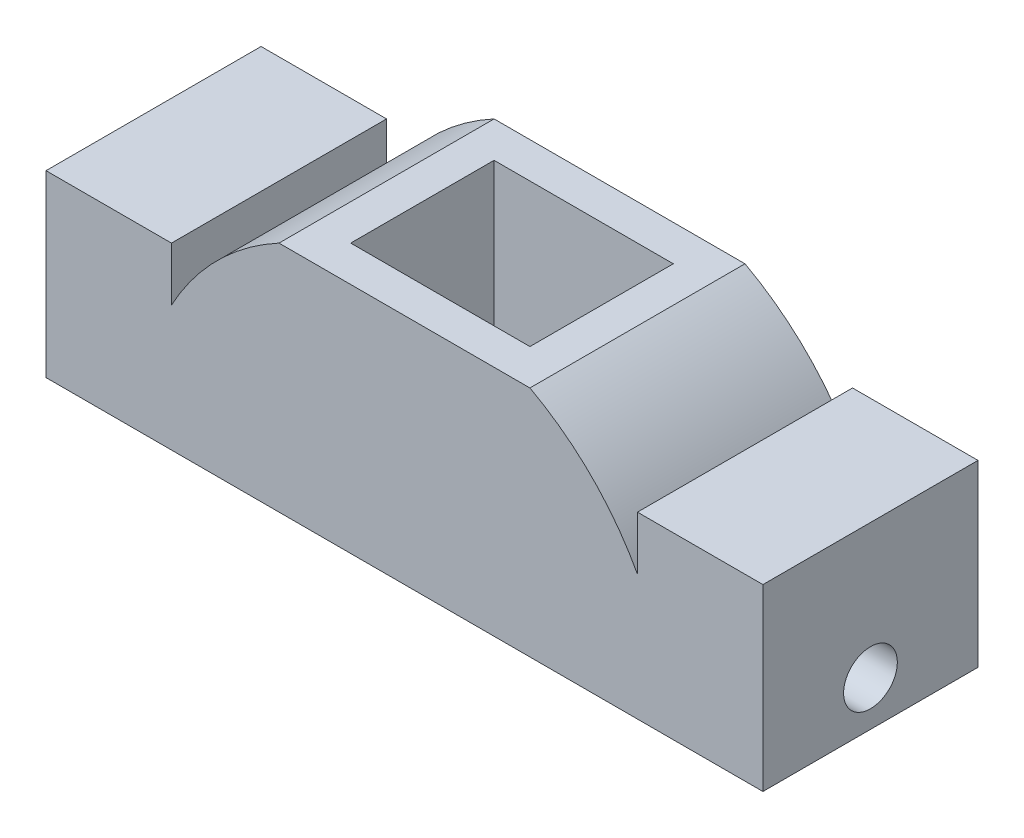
ISO-10303-21;
HEADER;
FILE_DESCRIPTION(('STEP AP214'),'2;1');
FILE_NAME('part.step','',(''),(''),'','','');
FILE_SCHEMA(('AUTOMOTIVE_DESIGN { 1 0 10303 214 1 1 1 1 }'));
ENDSEC;
DATA;
#1=APPLICATION_CONTEXT('core data for automotive mechanical design processes');
#2=APPLICATION_PROTOCOL_DEFINITION('international standard','automotive_design',2000,#1);
#3=PRODUCT_CONTEXT('',#1,'mechanical');
#4=PRODUCT('Part','Part','',(#3));
#5=PRODUCT_RELATED_PRODUCT_CATEGORY('part','',(#4));
#6=PRODUCT_DEFINITION_FORMATION('','',#4);
#7=PRODUCT_DEFINITION_CONTEXT('part definition',#1,'design');
#8=PRODUCT_DEFINITION('design','',#6,#7);
#9=PRODUCT_DEFINITION_SHAPE('','',#8);
#10=(LENGTH_UNIT() NAMED_UNIT(*) SI_UNIT(.MILLI.,.METRE.));
#11=(NAMED_UNIT(*) PLANE_ANGLE_UNIT() SI_UNIT($,.RADIAN.));
#12=(NAMED_UNIT(*) SI_UNIT($,.STERADIAN.) SOLID_ANGLE_UNIT());
#13=UNCERTAINTY_MEASURE_WITH_UNIT(LENGTH_MEASURE(1.E-05),#10,'distance_accuracy_value','');
#14=(GEOMETRIC_REPRESENTATION_CONTEXT(3) GLOBAL_UNCERTAINTY_ASSIGNED_CONTEXT((#13)) GLOBAL_UNIT_ASSIGNED_CONTEXT((#10,
#11,#12)) REPRESENTATION_CONTEXT('',''));
#15=CARTESIAN_POINT('',(0.,0.,0.));
#16=DIRECTION('',(0.,0.,1.));
#17=DIRECTION('',(1.,0.,0.));
#18=AXIS2_PLACEMENT_3D('',#15,#16,#17);
#19=CARTESIAN_POINT('',(0.,0.,60.));
#20=DIRECTION('',(0.,0.,-1.));
#21=DIRECTION('',(-1.,0.,0.));
#22=AXIS2_PLACEMENT_3D('',#19,#20,#21);
#23=CYLINDRICAL_SURFACE('',#22,73.824115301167);
#24=CARTESIAN_POINT('',(0.,0.,0.));
#25=DIRECTION('',(0.,0.,1.));
#26=DIRECTION('',(1.,0.,0.));
#27=AXIS2_PLACEMENT_3D('',#24,#25,#26);
#28=CIRCLE('',#27,73.824115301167);
#29=CARTESIAN_POINT('',(-35.,65.,0.));
#30=VERTEX_POINT('',#29);
#31=CARTESIAN_POINT('',(-65.,35.,0.));
#32=VERTEX_POINT('',#31);
#33=EDGE_CURVE('E183',#30,#32,#28,.T.);
#34=ORIENTED_EDGE('',*,*,#33,.T.);
#35=DIRECTION('',(0.,0.,-1.));
#36=VECTOR('',#35,1.);
#37=CARTESIAN_POINT('',(-65.,35.,60.));
#38=LINE('',#37,#36);
#39=CARTESIAN_POINT('',(-65.,35.,60.));
#40=VERTEX_POINT('',#39);
#41=EDGE_CURVE('E11',#40,#32,#38,.T.);
#42=ORIENTED_EDGE('',*,*,#41,.F.);
#43=CARTESIAN_POINT('',(0.,0.,60.));
#44=DIRECTION('',(0.,0.,1.));
#45=DIRECTION('',(1.,0.,0.));
#46=AXIS2_PLACEMENT_3D('',#43,#44,#45);
#47=CIRCLE('',#46,73.824115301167);
#48=CARTESIAN_POINT('',(-35.,65.,60.));
#49=VERTEX_POINT('',#48);
#50=EDGE_CURVE('E206',#49,#40,#47,.T.);
#51=ORIENTED_EDGE('',*,*,#50,.F.);
#52=DIRECTION('',(0.,0.,-1.));
#53=VECTOR('',#52,1.);
#54=CARTESIAN_POINT('',(-35.,65.,60.));
#55=LINE('',#54,#53);
#56=EDGE_CURVE('E227',#49,#30,#55,.T.);
#57=ORIENTED_EDGE('',*,*,#56,.T.);
#58=EDGE_LOOP('',(#34,#42,#51,#57));
#59=FACE_BOUND('',#58,.T.);
#60=ADVANCED_FACE('F33',(#59),#23,.T.);
#61=CARTESIAN_POINT('',(-65.,50.,60.));
#62=DIRECTION('',(-1.,0.,0.));
#63=DIRECTION('',(0.,0.,1.));
#64=AXIS2_PLACEMENT_3D('',#61,#62,#63);
#65=PLANE('',#64);
#66=DIRECTION('',(0.,1.,0.));
#67=VECTOR('',#66,1.);
#68=CARTESIAN_POINT('',(-65.,50.,0.));
#69=LINE('',#68,#67);
#70=CARTESIAN_POINT('',(-65.,50.,0.));
#71=VERTEX_POINT('',#70);
#72=EDGE_CURVE('E188',#32,#71,#69,.T.);
#73=ORIENTED_EDGE('',*,*,#72,.T.);
#74=DIRECTION('',(0.,0.,-1.));
#75=VECTOR('',#74,1.);
#76=CARTESIAN_POINT('',(-65.,50.,60.));
#77=LINE('',#76,#75);
#78=CARTESIAN_POINT('',(-65.,50.,60.));
#79=VERTEX_POINT('',#78);
#80=EDGE_CURVE('E40',#79,#71,#77,.T.);
#81=ORIENTED_EDGE('',*,*,#80,.F.);
#82=DIRECTION('',(0.,1.,0.));
#83=VECTOR('',#82,1.);
#84=CARTESIAN_POINT('',(-65.,50.,60.));
#85=LINE('',#84,#83);
#86=EDGE_CURVE('E209',#40,#79,#85,.T.);
#87=ORIENTED_EDGE('',*,*,#86,.F.);
#88=ORIENTED_EDGE('',*,*,#41,.T.);
#89=EDGE_LOOP('',(#73,#81,#87,#88));
#90=FACE_BOUND('',#89,.T.);
#91=ADVANCED_FACE('F278',(#90),#65,.F.);
#92=CARTESIAN_POINT('',(-100.,50.,60.));
#93=DIRECTION('',(0.,-1.,0.));
#94=DIRECTION('',(1.,0.,0.));
#95=AXIS2_PLACEMENT_3D('',#92,#93,#94);
#96=PLANE('',#95);
#97=DIRECTION('',(-1.,0.,0.));
#98=VECTOR('',#97,1.);
#99=CARTESIAN_POINT('',(-100.,50.,0.));
#100=LINE('',#99,#98);
#101=CARTESIAN_POINT('',(-100.,50.,0.));
#102=VERTEX_POINT('',#101);
#103=EDGE_CURVE('E190',#71,#102,#100,.T.);
#104=ORIENTED_EDGE('',*,*,#103,.T.);
#105=DIRECTION('',(0.,0.,-1.));
#106=VECTOR('',#105,1.);
#107=CARTESIAN_POINT('',(-100.,50.,60.));
#108=LINE('',#107,#106);
#109=CARTESIAN_POINT('',(-100.,50.,60.));
#110=VERTEX_POINT('',#109);
#111=EDGE_CURVE('E248',#110,#102,#108,.T.);
#112=ORIENTED_EDGE('',*,*,#111,.F.);
#113=DIRECTION('',(-1.,0.,0.));
#114=VECTOR('',#113,1.);
#115=CARTESIAN_POINT('',(-100.,50.,60.));
#116=LINE('',#115,#114);
#117=EDGE_CURVE('E211',#79,#110,#116,.T.);
#118=ORIENTED_EDGE('',*,*,#117,.F.);
#119=ORIENTED_EDGE('',*,*,#80,.T.);
#120=EDGE_LOOP('',(#104,#112,#118,#119));
#121=FACE_BOUND('',#120,.T.);
#122=ADVANCED_FACE('F255',(#121),#96,.F.);
#123=CARTESIAN_POINT('',(-100.,50.,60.));
#124=DIRECTION('',(1.,0.,0.));
#125=DIRECTION('',(0.,0.,-1.));
#126=AXIS2_PLACEMENT_3D('',#123,#124,#125);
#127=PLANE('',#126);
#128=CARTESIAN_POINT('',(-100.,12.5,30.));
#129=DIRECTION('',(1.,0.,0.));
#130=DIRECTION('',(0.,0.,-1.));
#131=AXIS2_PLACEMENT_3D('',#128,#129,#130);
#132=CIRCLE('',#131,7.5);
#133=CARTESIAN_POINT('',(-100.,12.5,22.5));
#134=VERTEX_POINT('',#133);
#135=EDGE_CURVE('E325',#134,#134,#132,.T.);
#136=ORIENTED_EDGE('',*,*,#135,.T.);
#137=EDGE_LOOP('',(#136));
#138=FACE_BOUND('',#137,.T.);
#139=DIRECTION('',(0.,-1.,0.));
#140=VECTOR('',#139,1.);
#141=CARTESIAN_POINT('',(-100.,50.,0.));
#142=LINE('',#141,#140);
#143=CARTESIAN_POINT('',(-100.,0.,0.));
#144=VERTEX_POINT('',#143);
#145=EDGE_CURVE('E192',#102,#144,#142,.T.);
#146=ORIENTED_EDGE('',*,*,#145,.T.);
#147=DIRECTION('',(0.,0.,-1.));
#148=VECTOR('',#147,1.);
#149=CARTESIAN_POINT('',(-100.,0.,60.));
#150=LINE('',#149,#148);
#151=CARTESIAN_POINT('',(-100.,0.,60.));
#152=VERTEX_POINT('',#151);
#153=EDGE_CURVE('E245',#152,#144,#150,.T.);
#154=ORIENTED_EDGE('',*,*,#153,.F.);
#155=DIRECTION('',(0.,-1.,0.));
#156=VECTOR('',#155,1.);
#157=CARTESIAN_POINT('',(-100.,50.,60.));
#158=LINE('',#157,#156);
#159=EDGE_CURVE('E213',#110,#152,#158,.T.);
#160=ORIENTED_EDGE('',*,*,#159,.F.);
#161=ORIENTED_EDGE('',*,*,#111,.T.);
#162=EDGE_LOOP('',(#146,#154,#160,#161));
#163=FACE_BOUND('',#162,.T.);
#164=ADVANCED_FACE('F266',(#138,#163),#127,.F.);
#165=CARTESIAN_POINT('',(-100.,0.,60.));
#166=DIRECTION('',(0.,1.,0.));
#167=DIRECTION('',(0.,0.,1.));
#168=AXIS2_PLACEMENT_3D('',#165,#166,#167);
#169=PLANE('',#168);
#170=DIRECTION('',(1.,0.,0.));
#171=VECTOR('',#170,1.);
#172=CARTESIAN_POINT('',(-100.,0.,0.));
#173=LINE('',#172,#171);
#174=CARTESIAN_POINT('',(100.,0.,0.));
#175=VERTEX_POINT('',#174);
#176=EDGE_CURVE('E194',#144,#175,#173,.T.);
#177=ORIENTED_EDGE('',*,*,#176,.T.);
#178=DIRECTION('',(0.,0.,-1.));
#179=VECTOR('',#178,1.);
#180=CARTESIAN_POINT('',(100.,0.,60.));
#181=LINE('',#180,#179);
#182=CARTESIAN_POINT('',(100.,0.,60.));
#183=VERTEX_POINT('',#182);
#184=EDGE_CURVE('E242',#183,#175,#181,.T.);
#185=ORIENTED_EDGE('',*,*,#184,.F.);
#186=DIRECTION('',(1.,0.,0.));
#187=VECTOR('',#186,1.);
#188=CARTESIAN_POINT('',(-100.,0.,60.));
#189=LINE('',#188,#187);
#190=EDGE_CURVE('E215',#152,#183,#189,.T.);
#191=ORIENTED_EDGE('',*,*,#190,.F.);
#192=ORIENTED_EDGE('',*,*,#153,.T.);
#193=EDGE_LOOP('',(#177,#185,#191,#192));
#194=FACE_BOUND('',#193,.T.);
#195=ADVANCED_FACE('F270',(#194),#169,.F.);
#196=CARTESIAN_POINT('',(100.,50.,60.));
#197=DIRECTION('',(-1.,0.,0.));
#198=DIRECTION('',(0.,0.,1.));
#199=AXIS2_PLACEMENT_3D('',#196,#197,#198);
#200=PLANE('',#199);
#201=CARTESIAN_POINT('',(100.,12.5,30.));
#202=DIRECTION('',(1.,0.,0.));
#203=DIRECTION('',(0.,0.,-1.));
#204=AXIS2_PLACEMENT_3D('',#201,#202,#203);
#205=CIRCLE('',#204,7.5);
#206=CARTESIAN_POINT('',(100.,12.5,22.5));
#207=VERTEX_POINT('',#206);
#208=EDGE_CURVE('E327',#207,#207,#205,.T.);
#209=ORIENTED_EDGE('',*,*,#208,.F.);
#210=EDGE_LOOP('',(#209));
#211=FACE_BOUND('',#210,.T.);
#212=DIRECTION('',(0.,1.,0.));
#213=VECTOR('',#212,1.);
#214=CARTESIAN_POINT('',(100.,50.,0.));
#215=LINE('',#214,#213);
#216=CARTESIAN_POINT('',(100.,50.,0.));
#217=VERTEX_POINT('',#216);
#218=EDGE_CURVE('E196',#175,#217,#215,.T.);
#219=ORIENTED_EDGE('',*,*,#218,.T.);
#220=DIRECTION('',(0.,0.,-1.));
#221=VECTOR('',#220,1.);
#222=CARTESIAN_POINT('',(100.,50.,60.));
#223=LINE('',#222,#221);
#224=CARTESIAN_POINT('',(100.,50.,60.));
#225=VERTEX_POINT('',#224);
#226=EDGE_CURVE('E239',#225,#217,#223,.T.);
#227=ORIENTED_EDGE('',*,*,#226,.F.);
#228=DIRECTION('',(0.,1.,0.));
#229=VECTOR('',#228,1.);
#230=CARTESIAN_POINT('',(100.,50.,60.));
#231=LINE('',#230,#229);
#232=EDGE_CURVE('E217',#183,#225,#231,.T.);
#233=ORIENTED_EDGE('',*,*,#232,.F.);
#234=ORIENTED_EDGE('',*,*,#184,.T.);
#235=EDGE_LOOP('',(#219,#227,#233,#234));
#236=FACE_BOUND('',#235,.T.);
#237=ADVANCED_FACE('F299',(#211,#236),#200,.F.);
#238=CARTESIAN_POINT('',(100.,50.,60.));
#239=DIRECTION('',(0.,-1.,0.));
#240=DIRECTION('',(1.,0.,0.));
#241=AXIS2_PLACEMENT_3D('',#238,#239,#240);
#242=PLANE('',#241);
#243=DIRECTION('',(-1.,0.,0.));
#244=VECTOR('',#243,1.);
#245=CARTESIAN_POINT('',(100.,50.,0.));
#246=LINE('',#245,#244);
#247=CARTESIAN_POINT('',(65.,50.,0.));
#248=VERTEX_POINT('',#247);
#249=EDGE_CURVE('E198',#217,#248,#246,.T.);
#250=ORIENTED_EDGE('',*,*,#249,.T.);
#251=DIRECTION('',(0.,0.,-1.));
#252=VECTOR('',#251,1.);
#253=CARTESIAN_POINT('',(65.,50.,60.));
#254=LINE('',#253,#252);
#255=CARTESIAN_POINT('',(65.,50.,60.));
#256=VERTEX_POINT('',#255);
#257=EDGE_CURVE('E236',#256,#248,#254,.T.);
#258=ORIENTED_EDGE('',*,*,#257,.F.);
#259=DIRECTION('',(-1.,0.,0.));
#260=VECTOR('',#259,1.);
#261=CARTESIAN_POINT('',(100.,50.,60.));
#262=LINE('',#261,#260);
#263=EDGE_CURVE('E219',#225,#256,#262,.T.);
#264=ORIENTED_EDGE('',*,*,#263,.F.);
#265=ORIENTED_EDGE('',*,*,#226,.T.);
#266=EDGE_LOOP('',(#250,#258,#264,#265));
#267=FACE_BOUND('',#266,.T.);
#268=ADVANCED_FACE('F296',(#267),#242,.F.);
#269=CARTESIAN_POINT('',(65.,50.,60.));
#270=DIRECTION('',(1.,0.,0.));
#271=DIRECTION('',(0.,0.,-1.));
#272=AXIS2_PLACEMENT_3D('',#269,#270,#271);
#273=PLANE('',#272);
#274=DIRECTION('',(0.,-1.,0.));
#275=VECTOR('',#274,1.);
#276=CARTESIAN_POINT('',(65.,50.,0.));
#277=LINE('',#276,#275);
#278=CARTESIAN_POINT('',(65.,35.,0.));
#279=VERTEX_POINT('',#278);
#280=EDGE_CURVE('E200',#248,#279,#277,.T.);
#281=ORIENTED_EDGE('',*,*,#280,.T.);
#282=DIRECTION('',(0.,0.,-1.));
#283=VECTOR('',#282,1.);
#284=CARTESIAN_POINT('',(65.,35.,60.));
#285=LINE('',#284,#283);
#286=CARTESIAN_POINT('',(65.,35.,60.));
#287=VERTEX_POINT('',#286);
#288=EDGE_CURVE('E233',#287,#279,#285,.T.);
#289=ORIENTED_EDGE('',*,*,#288,.F.);
#290=DIRECTION('',(0.,-1.,0.));
#291=VECTOR('',#290,1.);
#292=CARTESIAN_POINT('',(65.,50.,60.));
#293=LINE('',#292,#291);
#294=EDGE_CURVE('E221',#256,#287,#293,.T.);
#295=ORIENTED_EDGE('',*,*,#294,.F.);
#296=ORIENTED_EDGE('',*,*,#257,.T.);
#297=EDGE_LOOP('',(#281,#289,#295,#296));
#298=FACE_BOUND('',#297,.T.);
#299=ADVANCED_FACE('F292',(#298),#273,.F.);
#300=CARTESIAN_POINT('',(0.,0.,60.));
#301=DIRECTION('',(0.,0.,-1.));
#302=DIRECTION('',(-1.,0.,0.));
#303=AXIS2_PLACEMENT_3D('',#300,#301,#302);
#304=CYLINDRICAL_SURFACE('',#303,73.824115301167);
#305=CARTESIAN_POINT('',(0.,0.,0.));
#306=DIRECTION('',(0.,0.,1.));
#307=DIRECTION('',(-1.,0.,0.));
#308=AXIS2_PLACEMENT_3D('',#305,#306,#307);
#309=CIRCLE('',#308,73.824115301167);
#310=CARTESIAN_POINT('',(35.,65.,0.));
#311=VERTEX_POINT('',#310);
#312=EDGE_CURVE('E202',#279,#311,#309,.T.);
#313=ORIENTED_EDGE('',*,*,#312,.T.);
#314=DIRECTION('',(0.,0.,-1.));
#315=VECTOR('',#314,1.);
#316=CARTESIAN_POINT('',(35.,65.,60.));
#317=LINE('',#316,#315);
#318=CARTESIAN_POINT('',(35.,65.,60.));
#319=VERTEX_POINT('',#318);
#320=EDGE_CURVE('E230',#319,#311,#317,.T.);
#321=ORIENTED_EDGE('',*,*,#320,.F.);
#322=CARTESIAN_POINT('',(0.,0.,60.));
#323=DIRECTION('',(0.,0.,1.));
#324=DIRECTION('',(-1.,0.,0.));
#325=AXIS2_PLACEMENT_3D('',#322,#323,#324);
#326=CIRCLE('',#325,73.824115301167);
#327=EDGE_CURVE('E223',#287,#319,#326,.T.);
#328=ORIENTED_EDGE('',*,*,#327,.F.);
#329=ORIENTED_EDGE('',*,*,#288,.T.);
#330=EDGE_LOOP('',(#313,#321,#328,#329));
#331=FACE_BOUND('',#330,.T.);
#332=ADVANCED_FACE('F288',(#331),#304,.T.);
#333=CARTESIAN_POINT('',(-35.,65.,60.));
#334=DIRECTION('',(0.,-1.,0.));
#335=DIRECTION('',(0.,0.,-1.));
#336=AXIS2_PLACEMENT_3D('',#333,#334,#335);
#337=PLANE('',#336);
#338=DIRECTION('',(-1.,0.,0.));
#339=VECTOR('',#338,1.);
#340=CARTESIAN_POINT('',(25.,65.,10.));
#341=LINE('',#340,#339);
#342=CARTESIAN_POINT('',(25.,65.,10.));
#343=VERTEX_POINT('',#342);
#344=CARTESIAN_POINT('',(-25.,65.,10.));
#345=VERTEX_POINT('',#344);
#346=EDGE_CURVE('E155',#343,#345,#341,.T.);
#347=ORIENTED_EDGE('',*,*,#346,.F.);
#348=DIRECTION('',(0.,0.,-1.));
#349=VECTOR('',#348,1.);
#350=CARTESIAN_POINT('',(25.,65.,50.));
#351=LINE('',#350,#349);
#352=CARTESIAN_POINT('',(25.,65.,50.));
#353=VERTEX_POINT('',#352);
#354=EDGE_CURVE('E160',#353,#343,#351,.T.);
#355=ORIENTED_EDGE('',*,*,#354,.F.);
#356=DIRECTION('',(1.,0.,0.));
#357=VECTOR('',#356,1.);
#358=CARTESIAN_POINT('',(-25.,65.,50.));
#359=LINE('',#358,#357);
#360=CARTESIAN_POINT('',(-25.,65.,50.));
#361=VERTEX_POINT('',#360);
#362=EDGE_CURVE('E165',#361,#353,#359,.T.);
#363=ORIENTED_EDGE('',*,*,#362,.F.);
#364=DIRECTION('',(0.,0.,1.));
#365=VECTOR('',#364,1.);
#366=CARTESIAN_POINT('',(-25.,65.,10.));
#367=LINE('',#366,#365);
#368=EDGE_CURVE('E143',#345,#361,#367,.T.);
#369=ORIENTED_EDGE('',*,*,#368,.F.);
#370=EDGE_LOOP('',(#347,#355,#363,#369));
#371=FACE_BOUND('',#370,.T.);
#372=DIRECTION('',(-1.,0.,0.));
#373=VECTOR('',#372,1.);
#374=CARTESIAN_POINT('',(-35.,65.,0.));
#375=LINE('',#374,#373);
#376=EDGE_CURVE('E204',#311,#30,#375,.T.);
#377=ORIENTED_EDGE('',*,*,#376,.T.);
#378=ORIENTED_EDGE('',*,*,#56,.F.);
#379=DIRECTION('',(-1.,0.,0.));
#380=VECTOR('',#379,1.);
#381=CARTESIAN_POINT('',(-35.,65.,60.));
#382=LINE('',#381,#380);
#383=EDGE_CURVE('E225',#319,#49,#382,.T.);
#384=ORIENTED_EDGE('',*,*,#383,.F.);
#385=ORIENTED_EDGE('',*,*,#320,.T.);
#386=EDGE_LOOP('',(#377,#378,#384,#385));
#387=FACE_BOUND('',#386,.T.);
#388=ADVANCED_FACE('F162',(#371,#387),#337,.F.);
#389=CARTESIAN_POINT('',(0.,0.,60.));
#390=DIRECTION('',(0.,0.,1.));
#391=DIRECTION('',(1.,0.,0.));
#392=AXIS2_PLACEMENT_3D('',#389,#390,#391);
#393=PLANE('',#392);
#394=ORIENTED_EDGE('',*,*,#50,.T.);
#395=ORIENTED_EDGE('',*,*,#86,.T.);
#396=ORIENTED_EDGE('',*,*,#117,.T.);
#397=ORIENTED_EDGE('',*,*,#159,.T.);
#398=ORIENTED_EDGE('',*,*,#190,.T.);
#399=ORIENTED_EDGE('',*,*,#232,.T.);
#400=ORIENTED_EDGE('',*,*,#263,.T.);
#401=ORIENTED_EDGE('',*,*,#294,.T.);
#402=ORIENTED_EDGE('',*,*,#327,.T.);
#403=ORIENTED_EDGE('',*,*,#383,.T.);
#404=EDGE_LOOP('',(#394,#395,#396,#397,#398,#399,#400,#401,#402,#403));
#405=FACE_BOUND('',#404,.T.);
#406=ADVANCED_FACE('F274',(#405),#393,.T.);
#407=CARTESIAN_POINT('',(0.,0.,0.));
#408=DIRECTION('',(0.,0.,1.));
#409=DIRECTION('',(1.,0.,0.));
#410=AXIS2_PLACEMENT_3D('',#407,#408,#409);
#411=PLANE('',#410);
#412=ORIENTED_EDGE('',*,*,#33,.F.);
#413=ORIENTED_EDGE('',*,*,#376,.F.);
#414=ORIENTED_EDGE('',*,*,#312,.F.);
#415=ORIENTED_EDGE('',*,*,#280,.F.);
#416=ORIENTED_EDGE('',*,*,#249,.F.);
#417=ORIENTED_EDGE('',*,*,#218,.F.);
#418=ORIENTED_EDGE('',*,*,#176,.F.);
#419=ORIENTED_EDGE('',*,*,#145,.F.);
#420=ORIENTED_EDGE('',*,*,#103,.F.);
#421=ORIENTED_EDGE('',*,*,#72,.F.);
#422=EDGE_LOOP('',(#412,#413,#414,#415,#416,#417,#418,#419,#420,#421));
#423=FACE_BOUND('',#422,.T.);
#424=ADVANCED_FACE('F261',(#423),#411,.F.);
#425=CARTESIAN_POINT('',(25.,5.,50.));
#426=DIRECTION('',(1.,0.,0.));
#427=DIRECTION('',(0.,0.,-1.));
#428=AXIS2_PLACEMENT_3D('',#425,#426,#427);
#429=PLANE('',#428);
#430=DIRECTION('',(0.,0.,-1.));
#431=VECTOR('',#430,1.);
#432=CARTESIAN_POINT('',(25.,5.,50.));
#433=LINE('',#432,#431);
#434=CARTESIAN_POINT('',(25.,5.,30.));
#435=VERTEX_POINT('',#434);
#436=CARTESIAN_POINT('',(25.,5.,10.));
#437=VERTEX_POINT('',#436);
#438=EDGE_CURVE('E167',#435,#437,#433,.T.);
#439=ORIENTED_EDGE('',*,*,#438,.F.);
#440=CARTESIAN_POINT('',(25.,12.5,30.));
#441=DIRECTION('',(1.,0.,0.));
#442=DIRECTION('',(0.,0.,-1.));
#443=AXIS2_PLACEMENT_3D('',#440,#441,#442);
#444=CIRCLE('',#443,7.5);
#445=EDGE_CURVE('E50',#435,#435,#444,.T.);
#446=ORIENTED_EDGE('',*,*,#445,.T.);
#447=CARTESIAN_POINT('',(25.,5.,50.));
#448=VERTEX_POINT('',#447);
#449=EDGE_CURVE('E171',#448,#435,#433,.T.);
#450=ORIENTED_EDGE('',*,*,#449,.F.);
#451=DIRECTION('',(0.,1.,0.));
#452=VECTOR('',#451,1.);
#453=CARTESIAN_POINT('',(25.,5.,50.));
#454=LINE('',#453,#452);
#455=EDGE_CURVE('E181',#448,#353,#454,.T.);
#456=ORIENTED_EDGE('',*,*,#455,.T.);
#457=ORIENTED_EDGE('',*,*,#354,.T.);
#458=DIRECTION('',(0.,1.,0.));
#459=VECTOR('',#458,1.);
#460=CARTESIAN_POINT('',(25.,5.,10.));
#461=LINE('',#460,#459);
#462=EDGE_CURVE('E151',#437,#343,#461,.T.);
#463=ORIENTED_EDGE('',*,*,#462,.F.);
#464=EDGE_LOOP('',(#439,#446,#450,#456,#457,#463));
#465=FACE_BOUND('',#464,.T.);
#466=ADVANCED_FACE('F335',(#465),#429,.F.);
#467=CARTESIAN_POINT('',(-25.,5.,50.));
#468=DIRECTION('',(0.,0.,1.));
#469=DIRECTION('',(1.,0.,0.));
#470=AXIS2_PLACEMENT_3D('',#467,#468,#469);
#471=PLANE('',#470);
#472=ORIENTED_EDGE('',*,*,#362,.T.);
#473=ORIENTED_EDGE('',*,*,#455,.F.);
#474=DIRECTION('',(1.,0.,0.));
#475=VECTOR('',#474,1.);
#476=CARTESIAN_POINT('',(-25.,5.,50.));
#477=LINE('',#476,#475);
#478=CARTESIAN_POINT('',(-25.,5.,50.));
#479=VERTEX_POINT('',#478);
#480=EDGE_CURVE('E178',#479,#448,#477,.T.);
#481=ORIENTED_EDGE('',*,*,#480,.F.);
#482=DIRECTION('',(0.,1.,0.));
#483=VECTOR('',#482,1.);
#484=CARTESIAN_POINT('',(-25.,5.,50.));
#485=LINE('',#484,#483);
#486=EDGE_CURVE('E150',#479,#361,#485,.T.);
#487=ORIENTED_EDGE('',*,*,#486,.T.);
#488=EDGE_LOOP('',(#472,#473,#481,#487));
#489=FACE_BOUND('',#488,.T.);
#490=ADVANCED_FACE('F339',(#489),#471,.F.);
#491=CARTESIAN_POINT('',(-25.,5.,10.));
#492=DIRECTION('',(-1.,0.,0.));
#493=DIRECTION('',(0.,0.,1.));
#494=AXIS2_PLACEMENT_3D('',#491,#492,#493);
#495=PLANE('',#494);
#496=DIRECTION('',(0.,0.,1.));
#497=VECTOR('',#496,1.);
#498=CARTESIAN_POINT('',(-25.,5.,10.));
#499=LINE('',#498,#497);
#500=CARTESIAN_POINT('',(-25.,5.,30.));
#501=VERTEX_POINT('',#500);
#502=EDGE_CURVE('E176',#501,#479,#499,.T.);
#503=ORIENTED_EDGE('',*,*,#502,.F.);
#504=CARTESIAN_POINT('',(-25.,12.5,30.));
#505=DIRECTION('',(-1.,0.,0.));
#506=DIRECTION('',(0.,0.,1.));
#507=AXIS2_PLACEMENT_3D('',#504,#505,#506);
#508=CIRCLE('',#507,7.5);
#509=EDGE_CURVE('E45',#501,#501,#508,.T.);
#510=ORIENTED_EDGE('',*,*,#509,.T.);
#511=CARTESIAN_POINT('',(-25.,5.,10.));
#512=VERTEX_POINT('',#511);
#513=EDGE_CURVE('E146',#512,#501,#499,.T.);
#514=ORIENTED_EDGE('',*,*,#513,.F.);
#515=DIRECTION('',(0.,1.,0.));
#516=VECTOR('',#515,1.);
#517=CARTESIAN_POINT('',(-25.,5.,10.));
#518=LINE('',#517,#516);
#519=EDGE_CURVE('E137',#512,#345,#518,.T.);
#520=ORIENTED_EDGE('',*,*,#519,.T.);
#521=ORIENTED_EDGE('',*,*,#368,.T.);
#522=ORIENTED_EDGE('',*,*,#486,.F.);
#523=EDGE_LOOP('',(#503,#510,#514,#520,#521,#522));
#524=FACE_BOUND('',#523,.T.);
#525=ADVANCED_FACE('F140',(#524),#495,.F.);
#526=CARTESIAN_POINT('',(25.,5.,10.));
#527=DIRECTION('',(0.,0.,-1.));
#528=DIRECTION('',(-1.,0.,0.));
#529=AXIS2_PLACEMENT_3D('',#526,#527,#528);
#530=PLANE('',#529);
#531=ORIENTED_EDGE('',*,*,#346,.T.);
#532=ORIENTED_EDGE('',*,*,#519,.F.);
#533=DIRECTION('',(-1.,0.,0.));
#534=VECTOR('',#533,1.);
#535=CARTESIAN_POINT('',(25.,5.,10.));
#536=LINE('',#535,#534);
#537=EDGE_CURVE('E174',#437,#512,#536,.T.);
#538=ORIENTED_EDGE('',*,*,#537,.F.);
#539=ORIENTED_EDGE('',*,*,#462,.T.);
#540=EDGE_LOOP('',(#531,#532,#538,#539));
#541=FACE_BOUND('',#540,.T.);
#542=ADVANCED_FACE('F156',(#541),#530,.F.);
#543=CARTESIAN_POINT('',(25.,5.,10.));
#544=DIRECTION('',(0.,1.,0.));
#545=DIRECTION('',(0.,0.,1.));
#546=AXIS2_PLACEMENT_3D('',#543,#544,#545);
#547=PLANE('',#546);
#548=ORIENTED_EDGE('',*,*,#449,.T.);
#549=ORIENTED_EDGE('',*,*,#438,.T.);
#550=ORIENTED_EDGE('',*,*,#537,.T.);
#551=ORIENTED_EDGE('',*,*,#513,.T.);
#552=ORIENTED_EDGE('',*,*,#502,.T.);
#553=ORIENTED_EDGE('',*,*,#480,.T.);
#554=EDGE_LOOP('',(#548,#549,#550,#551,#552,#553));
#555=FACE_BOUND('',#554,.T.);
#556=ADVANCED_FACE('F341',(#555),#547,.T.);
#557=CARTESIAN_POINT('',(-100.,12.5,30.));
#558=DIRECTION('',(1.,0.,0.));
#559=DIRECTION('',(0.,0.,-1.));
#560=AXIS2_PLACEMENT_3D('',#557,#558,#559);
#561=CYLINDRICAL_SURFACE('',#560,7.5);
#562=ORIENTED_EDGE('',*,*,#135,.F.);
#563=EDGE_LOOP('',(#562));
#564=FACE_BOUND('',#563,.T.);
#565=ORIENTED_EDGE('',*,*,#509,.F.);
#566=EDGE_LOOP('',(#565));
#567=FACE_BOUND('',#566,.T.);
#568=ADVANCED_FACE('F343',(#564,#567),#561,.F.);
#569=ORIENTED_EDGE('',*,*,#208,.T.);
#570=EDGE_LOOP('',(#569));
#571=FACE_BOUND('',#570,.T.);
#572=ORIENTED_EDGE('',*,*,#445,.F.);
#573=EDGE_LOOP('',(#572));
#574=FACE_BOUND('',#573,.T.);
#575=ADVANCED_FACE('F349',(#571,#574),#561,.F.);
#576=CLOSED_SHELL('',(#60,#91,#122,#164,#195,#237,#268,#299,#332,#388,#406,#424,#466,#490,#525,
#542,#556,#568,#575));
#577=MANIFOLD_SOLID_BREP('B2',#576);
#578=ADVANCED_BREP_SHAPE_REPRESENTATION('',(#18,#577),#14);
#579=SHAPE_DEFINITION_REPRESENTATION(#9,#578);
ENDSEC;
END-ISO-10303-21;
